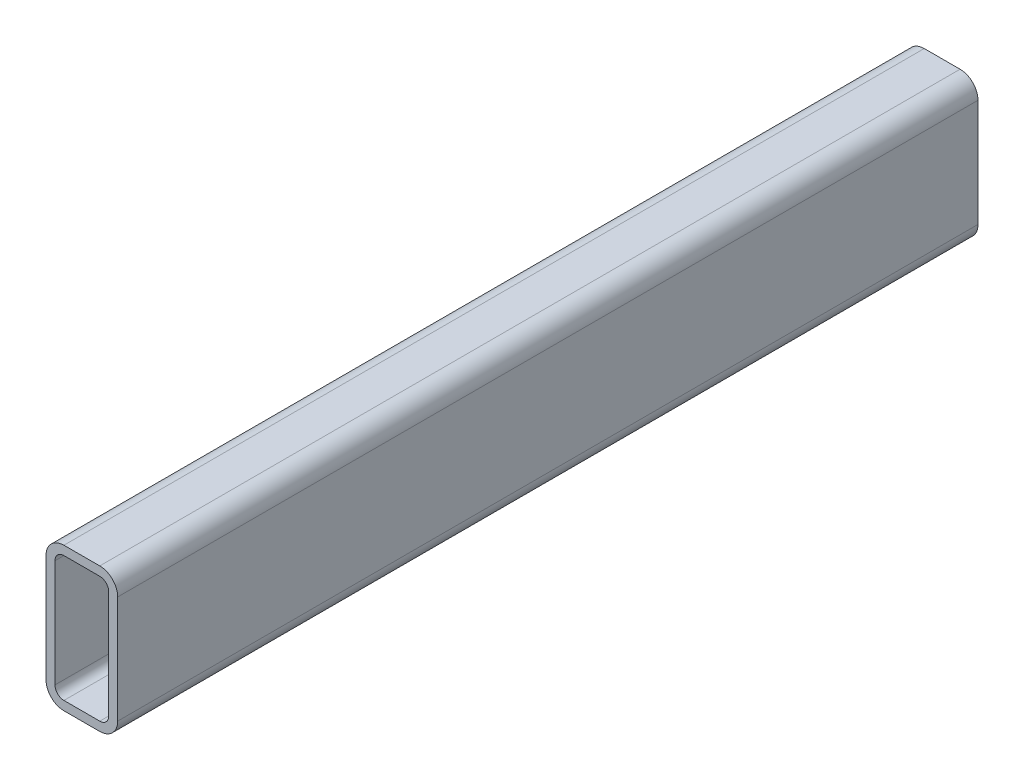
ISO-10303-21;
HEADER;
FILE_DESCRIPTION(('STEP AP214'),'2;1');
FILE_NAME('part.step','',(''),(''),'','','');
FILE_SCHEMA(('AUTOMOTIVE_DESIGN { 1 0 10303 214 1 1 1 1 }'));
ENDSEC;
DATA;
#1=APPLICATION_CONTEXT('core data for automotive mechanical design processes');
#2=APPLICATION_PROTOCOL_DEFINITION('international standard','automotive_design',2000,#1);
#3=PRODUCT_CONTEXT('',#1,'mechanical');
#4=PRODUCT('Part','Part','',(#3));
#5=PRODUCT_RELATED_PRODUCT_CATEGORY('part','',(#4));
#6=PRODUCT_DEFINITION_FORMATION('','',#4);
#7=PRODUCT_DEFINITION_CONTEXT('part definition',#1,'design');
#8=PRODUCT_DEFINITION('design','',#6,#7);
#9=PRODUCT_DEFINITION_SHAPE('','',#8);
#10=(LENGTH_UNIT() NAMED_UNIT(*) SI_UNIT(.MILLI.,.METRE.));
#11=(NAMED_UNIT(*) PLANE_ANGLE_UNIT() SI_UNIT($,.RADIAN.));
#12=(NAMED_UNIT(*) SI_UNIT($,.STERADIAN.) SOLID_ANGLE_UNIT());
#13=UNCERTAINTY_MEASURE_WITH_UNIT(LENGTH_MEASURE(1.E-05),#10,'distance_accuracy_value','');
#14=(GEOMETRIC_REPRESENTATION_CONTEXT(3) GLOBAL_UNCERTAINTY_ASSIGNED_CONTEXT((#13)) GLOBAL_UNIT_ASSIGNED_CONTEXT((#10,
#11,#12)) REPRESENTATION_CONTEXT('',''));
#15=CARTESIAN_POINT('',(0.,0.,0.));
#16=DIRECTION('',(0.,0.,1.));
#17=DIRECTION('',(1.,0.,0.));
#18=AXIS2_PLACEMENT_3D('',#15,#16,#17);
#19=CARTESIAN_POINT('',(6.35,44.45,304.8));
#20=DIRECTION('',(0.,0.,1.));
#21=DIRECTION('',(1.,0.,0.));
#22=AXIS2_PLACEMENT_3D('',#19,#20,#21);
#23=PLANE('',#22);
#24=CARTESIAN_POINT('',(6.35,44.45,304.8));
#25=DIRECTION('',(0.,0.,1.));
#26=DIRECTION('',(1.,0.,0.));
#27=AXIS2_PLACEMENT_3D('',#24,#25,#26);
#28=CIRCLE('',#27,6.35);
#29=CARTESIAN_POINT('',(6.35,50.8,304.8));
#30=VERTEX_POINT('',#29);
#31=CARTESIAN_POINT('',(0.,44.45,304.8));
#32=VERTEX_POINT('',#31);
#33=EDGE_CURVE('E211',#30,#32,#28,.T.);
#34=ORIENTED_EDGE('',*,*,#33,.T.);
#35=DIRECTION('',(0.,-1.,0.));
#36=VECTOR('',#35,1.);
#37=CARTESIAN_POINT('',(0.,6.35,304.8));
#38=LINE('',#37,#36);
#39=CARTESIAN_POINT('',(0.,6.35,304.8));
#40=VERTEX_POINT('',#39);
#41=EDGE_CURVE('E214',#32,#40,#38,.T.);
#42=ORIENTED_EDGE('',*,*,#41,.T.);
#43=CARTESIAN_POINT('',(6.35,6.35,304.8));
#44=DIRECTION('',(0.,0.,1.));
#45=DIRECTION('',(1.,0.,0.));
#46=AXIS2_PLACEMENT_3D('',#43,#44,#45);
#47=CIRCLE('',#46,6.35);
#48=CARTESIAN_POINT('',(6.35,0.,304.8));
#49=VERTEX_POINT('',#48);
#50=EDGE_CURVE('E217',#40,#49,#47,.T.);
#51=ORIENTED_EDGE('',*,*,#50,.T.);
#52=DIRECTION('',(1.,0.,0.));
#53=VECTOR('',#52,1.);
#54=CARTESIAN_POINT('',(19.05,0.,304.8));
#55=LINE('',#54,#53);
#56=CARTESIAN_POINT('',(19.05,0.,304.8));
#57=VERTEX_POINT('',#56);
#58=EDGE_CURVE('E219',#49,#57,#55,.T.);
#59=ORIENTED_EDGE('',*,*,#58,.T.);
#60=CARTESIAN_POINT('',(19.05,6.35,304.8));
#61=DIRECTION('',(0.,0.,1.));
#62=DIRECTION('',(1.,0.,0.));
#63=AXIS2_PLACEMENT_3D('',#60,#61,#62);
#64=CIRCLE('',#63,6.35);
#65=CARTESIAN_POINT('',(25.4,6.35,304.8));
#66=VERTEX_POINT('',#65);
#67=EDGE_CURVE('E221',#57,#66,#64,.T.);
#68=ORIENTED_EDGE('',*,*,#67,.T.);
#69=DIRECTION('',(0.,1.,0.));
#70=VECTOR('',#69,1.);
#71=CARTESIAN_POINT('',(25.4,44.45,304.8));
#72=LINE('',#71,#70);
#73=CARTESIAN_POINT('',(25.4,44.45,304.8));
#74=VERTEX_POINT('',#73);
#75=EDGE_CURVE('E223',#66,#74,#72,.T.);
#76=ORIENTED_EDGE('',*,*,#75,.T.);
#77=CARTESIAN_POINT('',(19.05,44.45,304.8));
#78=DIRECTION('',(0.,0.,1.));
#79=DIRECTION('',(1.,0.,0.));
#80=AXIS2_PLACEMENT_3D('',#77,#78,#79);
#81=CIRCLE('',#80,6.35);
#82=CARTESIAN_POINT('',(19.05,50.8,304.8));
#83=VERTEX_POINT('',#82);
#84=EDGE_CURVE('E225',#74,#83,#81,.T.);
#85=ORIENTED_EDGE('',*,*,#84,.T.);
#86=DIRECTION('',(-1.,0.,0.));
#87=VECTOR('',#86,1.);
#88=CARTESIAN_POINT('',(6.35,50.8,304.8));
#89=LINE('',#88,#87);
#90=EDGE_CURVE('E227',#83,#30,#89,.T.);
#91=ORIENTED_EDGE('',*,*,#90,.T.);
#92=EDGE_LOOP('',(#34,#42,#51,#59,#68,#76,#85,#91));
#93=FACE_BOUND('',#92,.T.);
#94=DIRECTION('',(0.,-1.,0.));
#95=VECTOR('',#94,1.);
#96=CARTESIAN_POINT('',(3.175,6.35,304.8));
#97=LINE('',#96,#95);
#98=CARTESIAN_POINT('',(3.175,44.45,304.8));
#99=VERTEX_POINT('',#98);
#100=CARTESIAN_POINT('',(3.175,6.35,304.8));
#101=VERTEX_POINT('',#100);
#102=EDGE_CURVE('E154',#99,#101,#97,.T.);
#103=ORIENTED_EDGE('',*,*,#102,.F.);
#104=CARTESIAN_POINT('',(6.35,44.45,304.8));
#105=DIRECTION('',(0.,0.,1.));
#106=DIRECTION('',(1.,0.,0.));
#107=AXIS2_PLACEMENT_3D('',#104,#105,#106);
#108=CIRCLE('',#107,3.175);
#109=CARTESIAN_POINT('',(6.35,47.625,304.8));
#110=VERTEX_POINT('',#109);
#111=EDGE_CURVE('E146',#110,#99,#108,.T.);
#112=ORIENTED_EDGE('',*,*,#111,.F.);
#113=DIRECTION('',(-1.,0.,0.));
#114=VECTOR('',#113,1.);
#115=CARTESIAN_POINT('',(6.35,47.625,304.8));
#116=LINE('',#115,#114);
#117=CARTESIAN_POINT('',(19.05,47.625,304.8));
#118=VERTEX_POINT('',#117);
#119=EDGE_CURVE('E179',#118,#110,#116,.T.);
#120=ORIENTED_EDGE('',*,*,#119,.F.);
#121=CARTESIAN_POINT('',(19.05,44.45,304.8));
#122=DIRECTION('',(0.,0.,1.));
#123=DIRECTION('',(1.,0.,0.));
#124=AXIS2_PLACEMENT_3D('',#121,#122,#123);
#125=CIRCLE('',#124,3.175);
#126=CARTESIAN_POINT('',(22.225,44.45,304.8));
#127=VERTEX_POINT('',#126);
#128=EDGE_CURVE('E177',#127,#118,#125,.T.);
#129=ORIENTED_EDGE('',*,*,#128,.F.);
#130=DIRECTION('',(0.,1.,0.));
#131=VECTOR('',#130,1.);
#132=CARTESIAN_POINT('',(22.225,44.45,304.8));
#133=LINE('',#132,#131);
#134=CARTESIAN_POINT('',(22.225,6.35,304.8));
#135=VERTEX_POINT('',#134);
#136=EDGE_CURVE('E175',#135,#127,#133,.T.);
#137=ORIENTED_EDGE('',*,*,#136,.F.);
#138=CARTESIAN_POINT('',(19.05,6.35,304.8));
#139=DIRECTION('',(0.,0.,1.));
#140=DIRECTION('',(1.,0.,0.));
#141=AXIS2_PLACEMENT_3D('',#138,#139,#140);
#142=CIRCLE('',#141,3.175);
#143=CARTESIAN_POINT('',(19.05,3.175,304.8));
#144=VERTEX_POINT('',#143);
#145=EDGE_CURVE('E173',#144,#135,#142,.T.);
#146=ORIENTED_EDGE('',*,*,#145,.F.);
#147=DIRECTION('',(1.,0.,0.));
#148=VECTOR('',#147,1.);
#149=CARTESIAN_POINT('',(19.05,3.175,304.8));
#150=LINE('',#149,#148);
#151=CARTESIAN_POINT('',(6.35,3.175,304.8));
#152=VERTEX_POINT('',#151);
#153=EDGE_CURVE('E169',#152,#144,#150,.T.);
#154=ORIENTED_EDGE('',*,*,#153,.F.);
#155=CARTESIAN_POINT('',(6.35,6.35,304.8));
#156=DIRECTION('',(0.,0.,1.));
#157=DIRECTION('',(1.,0.,0.));
#158=AXIS2_PLACEMENT_3D('',#155,#156,#157);
#159=CIRCLE('',#158,3.175);
#160=EDGE_CURVE('E167',#101,#152,#159,.T.);
#161=ORIENTED_EDGE('',*,*,#160,.F.);
#162=EDGE_LOOP('',(#103,#112,#120,#129,#137,#146,#154,#161));
#163=FACE_BOUND('',#162,.T.);
#164=ADVANCED_FACE('F33',(#93,#163),#23,.T.);
#165=CARTESIAN_POINT('',(6.35,44.45,0.));
#166=DIRECTION('',(0.,0.,1.));
#167=DIRECTION('',(1.,0.,0.));
#168=AXIS2_PLACEMENT_3D('',#165,#166,#167);
#169=PLANE('',#168);
#170=CARTESIAN_POINT('',(6.35,44.45,0.));
#171=DIRECTION('',(0.,0.,1.));
#172=DIRECTION('',(1.,0.,0.));
#173=AXIS2_PLACEMENT_3D('',#170,#171,#172);
#174=CIRCLE('',#173,6.35);
#175=CARTESIAN_POINT('',(6.35,50.8,0.));
#176=VERTEX_POINT('',#175);
#177=CARTESIAN_POINT('',(0.,44.45,0.));
#178=VERTEX_POINT('',#177);
#179=EDGE_CURVE('E162',#176,#178,#174,.T.);
#180=ORIENTED_EDGE('',*,*,#179,.F.);
#181=DIRECTION('',(-1.,0.,0.));
#182=VECTOR('',#181,1.);
#183=CARTESIAN_POINT('',(6.35,50.8,0.));
#184=LINE('',#183,#182);
#185=CARTESIAN_POINT('',(19.05,50.8,0.));
#186=VERTEX_POINT('',#185);
#187=EDGE_CURVE('E215',#186,#176,#184,.T.);
#188=ORIENTED_EDGE('',*,*,#187,.F.);
#189=CARTESIAN_POINT('',(19.05,44.45,0.));
#190=DIRECTION('',(0.,0.,1.));
#191=DIRECTION('',(1.,0.,0.));
#192=AXIS2_PLACEMENT_3D('',#189,#190,#191);
#193=CIRCLE('',#192,6.35);
#194=CARTESIAN_POINT('',(25.4,44.45,0.));
#195=VERTEX_POINT('',#194);
#196=EDGE_CURVE('E242',#195,#186,#193,.T.);
#197=ORIENTED_EDGE('',*,*,#196,.F.);
#198=DIRECTION('',(0.,1.,0.));
#199=VECTOR('',#198,1.);
#200=CARTESIAN_POINT('',(25.4,44.45,0.));
#201=LINE('',#200,#199);
#202=CARTESIAN_POINT('',(25.4,6.35,0.));
#203=VERTEX_POINT('',#202);
#204=EDGE_CURVE('E240',#203,#195,#201,.T.);
#205=ORIENTED_EDGE('',*,*,#204,.F.);
#206=CARTESIAN_POINT('',(19.05,6.35,0.));
#207=DIRECTION('',(0.,0.,1.));
#208=DIRECTION('',(1.,0.,0.));
#209=AXIS2_PLACEMENT_3D('',#206,#207,#208);
#210=CIRCLE('',#209,6.35);
#211=CARTESIAN_POINT('',(19.05,0.,0.));
#212=VERTEX_POINT('',#211);
#213=EDGE_CURVE('E238',#212,#203,#210,.T.);
#214=ORIENTED_EDGE('',*,*,#213,.F.);
#215=DIRECTION('',(1.,0.,0.));
#216=VECTOR('',#215,1.);
#217=CARTESIAN_POINT('',(19.05,0.,0.));
#218=LINE('',#217,#216);
#219=CARTESIAN_POINT('',(6.35,0.,0.));
#220=VERTEX_POINT('',#219);
#221=EDGE_CURVE('E236',#220,#212,#218,.T.);
#222=ORIENTED_EDGE('',*,*,#221,.F.);
#223=CARTESIAN_POINT('',(6.35,6.35,0.));
#224=DIRECTION('',(0.,0.,1.));
#225=DIRECTION('',(1.,0.,0.));
#226=AXIS2_PLACEMENT_3D('',#223,#224,#225);
#227=CIRCLE('',#226,6.35);
#228=CARTESIAN_POINT('',(0.,6.35,0.));
#229=VERTEX_POINT('',#228);
#230=EDGE_CURVE('E234',#229,#220,#227,.T.);
#231=ORIENTED_EDGE('',*,*,#230,.F.);
#232=DIRECTION('',(0.,-1.,0.));
#233=VECTOR('',#232,1.);
#234=CARTESIAN_POINT('',(0.,6.35,0.));
#235=LINE('',#234,#233);
#236=EDGE_CURVE('E232',#178,#229,#235,.T.);
#237=ORIENTED_EDGE('',*,*,#236,.F.);
#238=EDGE_LOOP('',(#180,#188,#197,#205,#214,#222,#231,#237));
#239=FACE_BOUND('',#238,.T.);
#240=CARTESIAN_POINT('',(6.35,44.45,0.));
#241=DIRECTION('',(0.,0.,1.));
#242=DIRECTION('',(1.,0.,0.));
#243=AXIS2_PLACEMENT_3D('',#240,#241,#242);
#244=CIRCLE('',#243,3.175);
#245=CARTESIAN_POINT('',(6.35,47.625,0.));
#246=VERTEX_POINT('',#245);
#247=CARTESIAN_POINT('',(3.175,44.45,0.));
#248=VERTEX_POINT('',#247);
#249=EDGE_CURVE('E56',#246,#248,#244,.T.);
#250=ORIENTED_EDGE('',*,*,#249,.T.);
#251=DIRECTION('',(0.,-1.,0.));
#252=VECTOR('',#251,1.);
#253=CARTESIAN_POINT('',(3.175,6.35,0.));
#254=LINE('',#253,#252);
#255=CARTESIAN_POINT('',(3.175,6.35,0.));
#256=VERTEX_POINT('',#255);
#257=EDGE_CURVE('E161',#248,#256,#254,.T.);
#258=ORIENTED_EDGE('',*,*,#257,.T.);
#259=CARTESIAN_POINT('',(6.35,6.35,0.));
#260=DIRECTION('',(0.,0.,1.));
#261=DIRECTION('',(1.,0.,0.));
#262=AXIS2_PLACEMENT_3D('',#259,#260,#261);
#263=CIRCLE('',#262,3.175);
#264=CARTESIAN_POINT('',(6.35,3.175,0.));
#265=VERTEX_POINT('',#264);
#266=EDGE_CURVE('E183',#256,#265,#263,.T.);
#267=ORIENTED_EDGE('',*,*,#266,.T.);
#268=DIRECTION('',(1.,0.,0.));
#269=VECTOR('',#268,1.);
#270=CARTESIAN_POINT('',(19.05,3.175,0.));
#271=LINE('',#270,#269);
#272=CARTESIAN_POINT('',(19.05,3.175,0.));
#273=VERTEX_POINT('',#272);
#274=EDGE_CURVE('E186',#265,#273,#271,.T.);
#275=ORIENTED_EDGE('',*,*,#274,.T.);
#276=CARTESIAN_POINT('',(19.05,6.35,0.));
#277=DIRECTION('',(0.,0.,1.));
#278=DIRECTION('',(1.,0.,0.));
#279=AXIS2_PLACEMENT_3D('',#276,#277,#278);
#280=CIRCLE('',#279,3.175);
#281=CARTESIAN_POINT('',(22.225,6.35,0.));
#282=VERTEX_POINT('',#281);
#283=EDGE_CURVE('E189',#273,#282,#280,.T.);
#284=ORIENTED_EDGE('',*,*,#283,.T.);
#285=DIRECTION('',(0.,1.,0.));
#286=VECTOR('',#285,1.);
#287=CARTESIAN_POINT('',(22.225,44.45,0.));
#288=LINE('',#287,#286);
#289=CARTESIAN_POINT('',(22.225,44.45,0.));
#290=VERTEX_POINT('',#289);
#291=EDGE_CURVE('E192',#282,#290,#288,.T.);
#292=ORIENTED_EDGE('',*,*,#291,.T.);
#293=CARTESIAN_POINT('',(19.05,44.45,0.));
#294=DIRECTION('',(0.,0.,1.));
#295=DIRECTION('',(1.,0.,0.));
#296=AXIS2_PLACEMENT_3D('',#293,#294,#295);
#297=CIRCLE('',#296,3.175);
#298=CARTESIAN_POINT('',(19.05,47.625,0.));
#299=VERTEX_POINT('',#298);
#300=EDGE_CURVE('E195',#290,#299,#297,.T.);
#301=ORIENTED_EDGE('',*,*,#300,.T.);
#302=DIRECTION('',(-1.,0.,0.));
#303=VECTOR('',#302,1.);
#304=CARTESIAN_POINT('',(6.35,47.625,0.));
#305=LINE('',#304,#303);
#306=EDGE_CURVE('E155',#299,#246,#305,.T.);
#307=ORIENTED_EDGE('',*,*,#306,.T.);
#308=EDGE_LOOP('',(#250,#258,#267,#275,#284,#292,#301,#307));
#309=FACE_BOUND('',#308,.T.);
#310=ADVANCED_FACE('F272',(#239,#309),#169,.F.);
#311=CARTESIAN_POINT('',(6.35,44.45,304.8));
#312=DIRECTION('',(0.,0.,-1.));
#313=DIRECTION('',(-1.,0.,0.));
#314=AXIS2_PLACEMENT_3D('',#311,#312,#313);
#315=CYLINDRICAL_SURFACE('',#314,6.35);
#316=ORIENTED_EDGE('',*,*,#179,.T.);
#317=DIRECTION('',(0.,0.,-1.));
#318=VECTOR('',#317,1.);
#319=CARTESIAN_POINT('',(0.,44.45,304.8));
#320=LINE('',#319,#318);
#321=EDGE_CURVE('E11',#32,#178,#320,.T.);
#322=ORIENTED_EDGE('',*,*,#321,.F.);
#323=ORIENTED_EDGE('',*,*,#33,.F.);
#324=DIRECTION('',(0.,0.,-1.));
#325=VECTOR('',#324,1.);
#326=CARTESIAN_POINT('',(6.35,50.8,304.8));
#327=LINE('',#326,#325);
#328=EDGE_CURVE('E229',#30,#176,#327,.T.);
#329=ORIENTED_EDGE('',*,*,#328,.T.);
#330=EDGE_LOOP('',(#316,#322,#323,#329));
#331=FACE_BOUND('',#330,.T.);
#332=ADVANCED_FACE('F35',(#331),#315,.T.);
#333=CARTESIAN_POINT('',(0.,6.35,304.8));
#334=DIRECTION('',(1.,0.,0.));
#335=DIRECTION('',(0.,0.,-1.));
#336=AXIS2_PLACEMENT_3D('',#333,#334,#335);
#337=PLANE('',#336);
#338=ORIENTED_EDGE('',*,*,#236,.T.);
#339=DIRECTION('',(0.,0.,-1.));
#340=VECTOR('',#339,1.);
#341=CARTESIAN_POINT('',(0.,6.35,304.8));
#342=LINE('',#341,#340);
#343=EDGE_CURVE('E41',#40,#229,#342,.T.);
#344=ORIENTED_EDGE('',*,*,#343,.F.);
#345=ORIENTED_EDGE('',*,*,#41,.F.);
#346=ORIENTED_EDGE('',*,*,#321,.T.);
#347=EDGE_LOOP('',(#338,#344,#345,#346));
#348=FACE_BOUND('',#347,.T.);
#349=ADVANCED_FACE('F289',(#348),#337,.F.);
#350=CARTESIAN_POINT('',(6.35,6.35,304.8));
#351=DIRECTION('',(0.,0.,-1.));
#352=DIRECTION('',(-1.,0.,0.));
#353=AXIS2_PLACEMENT_3D('',#350,#351,#352);
#354=CYLINDRICAL_SURFACE('',#353,6.35);
#355=ORIENTED_EDGE('',*,*,#230,.T.);
#356=DIRECTION('',(0.,0.,-1.));
#357=VECTOR('',#356,1.);
#358=CARTESIAN_POINT('',(6.35,0.,304.8));
#359=LINE('',#358,#357);
#360=EDGE_CURVE('E259',#49,#220,#359,.T.);
#361=ORIENTED_EDGE('',*,*,#360,.F.);
#362=ORIENTED_EDGE('',*,*,#50,.F.);
#363=ORIENTED_EDGE('',*,*,#343,.T.);
#364=EDGE_LOOP('',(#355,#361,#362,#363));
#365=FACE_BOUND('',#364,.T.);
#366=ADVANCED_FACE('F266',(#365),#354,.T.);
#367=CARTESIAN_POINT('',(19.05,0.,304.8));
#368=DIRECTION('',(0.,1.,0.));
#369=DIRECTION('',(0.,0.,1.));
#370=AXIS2_PLACEMENT_3D('',#367,#368,#369);
#371=PLANE('',#370);
#372=ORIENTED_EDGE('',*,*,#221,.T.);
#373=DIRECTION('',(0.,0.,-1.));
#374=VECTOR('',#373,1.);
#375=CARTESIAN_POINT('',(19.05,0.,304.8));
#376=LINE('',#375,#374);
#377=EDGE_CURVE('E256',#57,#212,#376,.T.);
#378=ORIENTED_EDGE('',*,*,#377,.F.);
#379=ORIENTED_EDGE('',*,*,#58,.F.);
#380=ORIENTED_EDGE('',*,*,#360,.T.);
#381=EDGE_LOOP('',(#372,#378,#379,#380));
#382=FACE_BOUND('',#381,.T.);
#383=ADVANCED_FACE('F278',(#382),#371,.F.);
#384=CARTESIAN_POINT('',(19.05,6.35,304.8));
#385=DIRECTION('',(0.,0.,-1.));
#386=DIRECTION('',(-1.,0.,0.));
#387=AXIS2_PLACEMENT_3D('',#384,#385,#386);
#388=CYLINDRICAL_SURFACE('',#387,6.35);
#389=ORIENTED_EDGE('',*,*,#213,.T.);
#390=DIRECTION('',(0.,0.,-1.));
#391=VECTOR('',#390,1.);
#392=CARTESIAN_POINT('',(25.4,6.35,304.8));
#393=LINE('',#392,#391);
#394=EDGE_CURVE('E253',#66,#203,#393,.T.);
#395=ORIENTED_EDGE('',*,*,#394,.F.);
#396=ORIENTED_EDGE('',*,*,#67,.F.);
#397=ORIENTED_EDGE('',*,*,#377,.T.);
#398=EDGE_LOOP('',(#389,#395,#396,#397));
#399=FACE_BOUND('',#398,.T.);
#400=ADVANCED_FACE('F282',(#399),#388,.T.);
#401=CARTESIAN_POINT('',(25.4,44.45,304.8));
#402=DIRECTION('',(-1.,0.,0.));
#403=DIRECTION('',(0.,0.,1.));
#404=AXIS2_PLACEMENT_3D('',#401,#402,#403);
#405=PLANE('',#404);
#406=ORIENTED_EDGE('',*,*,#204,.T.);
#407=DIRECTION('',(0.,0.,-1.));
#408=VECTOR('',#407,1.);
#409=CARTESIAN_POINT('',(25.4,44.45,304.8));
#410=LINE('',#409,#408);
#411=EDGE_CURVE('E250',#74,#195,#410,.T.);
#412=ORIENTED_EDGE('',*,*,#411,.F.);
#413=ORIENTED_EDGE('',*,*,#75,.F.);
#414=ORIENTED_EDGE('',*,*,#394,.T.);
#415=EDGE_LOOP('',(#406,#412,#413,#414));
#416=FACE_BOUND('',#415,.T.);
#417=ADVANCED_FACE('F302',(#416),#405,.F.);
#418=CARTESIAN_POINT('',(19.05,44.45,304.8));
#419=DIRECTION('',(0.,0.,-1.));
#420=DIRECTION('',(-1.,0.,0.));
#421=AXIS2_PLACEMENT_3D('',#418,#419,#420);
#422=CYLINDRICAL_SURFACE('',#421,6.35);
#423=ORIENTED_EDGE('',*,*,#196,.T.);
#424=DIRECTION('',(0.,0.,-1.));
#425=VECTOR('',#424,1.);
#426=CARTESIAN_POINT('',(19.05,50.8,304.8));
#427=LINE('',#426,#425);
#428=EDGE_CURVE('E247',#83,#186,#427,.T.);
#429=ORIENTED_EDGE('',*,*,#428,.F.);
#430=ORIENTED_EDGE('',*,*,#84,.F.);
#431=ORIENTED_EDGE('',*,*,#411,.T.);
#432=EDGE_LOOP('',(#423,#429,#430,#431));
#433=FACE_BOUND('',#432,.T.);
#434=ADVANCED_FACE('F300',(#433),#422,.T.);
#435=CARTESIAN_POINT('',(6.35,50.8,304.8));
#436=DIRECTION('',(0.,-1.,0.));
#437=DIRECTION('',(0.,0.,-1.));
#438=AXIS2_PLACEMENT_3D('',#435,#436,#437);
#439=PLANE('',#438);
#440=ORIENTED_EDGE('',*,*,#187,.T.);
#441=ORIENTED_EDGE('',*,*,#328,.F.);
#442=ORIENTED_EDGE('',*,*,#90,.F.);
#443=ORIENTED_EDGE('',*,*,#428,.T.);
#444=EDGE_LOOP('',(#440,#441,#442,#443));
#445=FACE_BOUND('',#444,.T.);
#446=ADVANCED_FACE('F295',(#445),#439,.F.);
#447=CARTESIAN_POINT('',(6.35,44.45,304.8));
#448=DIRECTION('',(0.,0.,-1.));
#449=DIRECTION('',(-1.,0.,0.));
#450=AXIS2_PLACEMENT_3D('',#447,#448,#449);
#451=CYLINDRICAL_SURFACE('',#450,3.175);
#452=ORIENTED_EDGE('',*,*,#249,.F.);
#453=DIRECTION('',(0.,0.,-1.));
#454=VECTOR('',#453,1.);
#455=CARTESIAN_POINT('',(6.35,47.625,304.8));
#456=LINE('',#455,#454);
#457=EDGE_CURVE('E150',#110,#246,#456,.T.);
#458=ORIENTED_EDGE('',*,*,#457,.F.);
#459=ORIENTED_EDGE('',*,*,#111,.T.);
#460=DIRECTION('',(0.,0.,-1.));
#461=VECTOR('',#460,1.);
#462=CARTESIAN_POINT('',(3.175,44.45,304.8));
#463=LINE('',#462,#461);
#464=EDGE_CURVE('E149',#99,#248,#463,.T.);
#465=ORIENTED_EDGE('',*,*,#464,.T.);
#466=EDGE_LOOP('',(#452,#458,#459,#465));
#467=FACE_BOUND('',#466,.T.);
#468=ADVANCED_FACE('F148',(#467),#451,.F.);
#469=CARTESIAN_POINT('',(3.175,6.35,304.8));
#470=DIRECTION('',(1.,0.,0.));
#471=DIRECTION('',(0.,0.,-1.));
#472=AXIS2_PLACEMENT_3D('',#469,#470,#471);
#473=PLANE('',#472);
#474=ORIENTED_EDGE('',*,*,#257,.F.);
#475=ORIENTED_EDGE('',*,*,#464,.F.);
#476=ORIENTED_EDGE('',*,*,#102,.T.);
#477=DIRECTION('',(0.,0.,-1.));
#478=VECTOR('',#477,1.);
#479=CARTESIAN_POINT('',(3.175,6.35,304.8));
#480=LINE('',#479,#478);
#481=EDGE_CURVE('E163',#101,#256,#480,.T.);
#482=ORIENTED_EDGE('',*,*,#481,.T.);
#483=EDGE_LOOP('',(#474,#475,#476,#482));
#484=FACE_BOUND('',#483,.T.);
#485=ADVANCED_FACE('F158',(#484),#473,.T.);
#486=CARTESIAN_POINT('',(6.35,6.35,304.8));
#487=DIRECTION('',(0.,0.,-1.));
#488=DIRECTION('',(-1.,0.,0.));
#489=AXIS2_PLACEMENT_3D('',#486,#487,#488);
#490=CYLINDRICAL_SURFACE('',#489,3.175);
#491=ORIENTED_EDGE('',*,*,#266,.F.);
#492=ORIENTED_EDGE('',*,*,#481,.F.);
#493=ORIENTED_EDGE('',*,*,#160,.T.);
#494=DIRECTION('',(0.,0.,-1.));
#495=VECTOR('',#494,1.);
#496=CARTESIAN_POINT('',(6.35,3.175,304.8));
#497=LINE('',#496,#495);
#498=EDGE_CURVE('E208',#152,#265,#497,.T.);
#499=ORIENTED_EDGE('',*,*,#498,.T.);
#500=EDGE_LOOP('',(#491,#492,#493,#499));
#501=FACE_BOUND('',#500,.T.);
#502=ADVANCED_FACE('F327',(#501),#490,.F.);
#503=CARTESIAN_POINT('',(19.05,3.175,304.8));
#504=DIRECTION('',(0.,1.,0.));
#505=DIRECTION('',(0.,0.,1.));
#506=AXIS2_PLACEMENT_3D('',#503,#504,#505);
#507=PLANE('',#506);
#508=ORIENTED_EDGE('',*,*,#274,.F.);
#509=ORIENTED_EDGE('',*,*,#498,.F.);
#510=ORIENTED_EDGE('',*,*,#153,.T.);
#511=DIRECTION('',(0.,0.,-1.));
#512=VECTOR('',#511,1.);
#513=CARTESIAN_POINT('',(19.05,3.175,304.8));
#514=LINE('',#513,#512);
#515=EDGE_CURVE('E206',#144,#273,#514,.T.);
#516=ORIENTED_EDGE('',*,*,#515,.T.);
#517=EDGE_LOOP('',(#508,#509,#510,#516));
#518=FACE_BOUND('',#517,.T.);
#519=ADVANCED_FACE('F331',(#518),#507,.T.);
#520=CARTESIAN_POINT('',(19.05,6.35,304.8));
#521=DIRECTION('',(0.,0.,-1.));
#522=DIRECTION('',(-1.,0.,0.));
#523=AXIS2_PLACEMENT_3D('',#520,#521,#522);
#524=CYLINDRICAL_SURFACE('',#523,3.175);
#525=ORIENTED_EDGE('',*,*,#283,.F.);
#526=ORIENTED_EDGE('',*,*,#515,.F.);
#527=ORIENTED_EDGE('',*,*,#145,.T.);
#528=DIRECTION('',(0.,0.,-1.));
#529=VECTOR('',#528,1.);
#530=CARTESIAN_POINT('',(22.225,6.35,304.8));
#531=LINE('',#530,#529);
#532=EDGE_CURVE('E204',#135,#282,#531,.T.);
#533=ORIENTED_EDGE('',*,*,#532,.T.);
#534=EDGE_LOOP('',(#525,#526,#527,#533));
#535=FACE_BOUND('',#534,.T.);
#536=ADVANCED_FACE('F337',(#535),#524,.F.);
#537=CARTESIAN_POINT('',(22.225,44.45,304.8));
#538=DIRECTION('',(-1.,0.,0.));
#539=DIRECTION('',(0.,0.,1.));
#540=AXIS2_PLACEMENT_3D('',#537,#538,#539);
#541=PLANE('',#540);
#542=ORIENTED_EDGE('',*,*,#291,.F.);
#543=ORIENTED_EDGE('',*,*,#532,.F.);
#544=ORIENTED_EDGE('',*,*,#136,.T.);
#545=DIRECTION('',(0.,0.,-1.));
#546=VECTOR('',#545,1.);
#547=CARTESIAN_POINT('',(22.225,44.45,304.8));
#548=LINE('',#547,#546);
#549=EDGE_CURVE('E202',#127,#290,#548,.T.);
#550=ORIENTED_EDGE('',*,*,#549,.T.);
#551=EDGE_LOOP('',(#542,#543,#544,#550));
#552=FACE_BOUND('',#551,.T.);
#553=ADVANCED_FACE('F341',(#552),#541,.T.);
#554=CARTESIAN_POINT('',(19.05,44.45,304.8));
#555=DIRECTION('',(0.,0.,-1.));
#556=DIRECTION('',(-1.,0.,0.));
#557=AXIS2_PLACEMENT_3D('',#554,#555,#556);
#558=CYLINDRICAL_SURFACE('',#557,3.175);
#559=ORIENTED_EDGE('',*,*,#300,.F.);
#560=ORIENTED_EDGE('',*,*,#549,.F.);
#561=ORIENTED_EDGE('',*,*,#128,.T.);
#562=DIRECTION('',(0.,0.,-1.));
#563=VECTOR('',#562,1.);
#564=CARTESIAN_POINT('',(19.05,47.625,304.8));
#565=LINE('',#564,#563);
#566=EDGE_CURVE('E48',#118,#299,#565,.T.);
#567=ORIENTED_EDGE('',*,*,#566,.T.);
#568=EDGE_LOOP('',(#559,#560,#561,#567));
#569=FACE_BOUND('',#568,.T.);
#570=ADVANCED_FACE('F345',(#569),#558,.F.);
#571=CARTESIAN_POINT('',(6.35,47.625,304.8));
#572=DIRECTION('',(0.,-1.,0.));
#573=DIRECTION('',(0.,0.,-1.));
#574=AXIS2_PLACEMENT_3D('',#571,#572,#573);
#575=PLANE('',#574);
#576=ORIENTED_EDGE('',*,*,#306,.F.);
#577=ORIENTED_EDGE('',*,*,#566,.F.);
#578=ORIENTED_EDGE('',*,*,#119,.T.);
#579=ORIENTED_EDGE('',*,*,#457,.T.);
#580=EDGE_LOOP('',(#576,#577,#578,#579));
#581=FACE_BOUND('',#580,.T.);
#582=ADVANCED_FACE('F349',(#581),#575,.T.);
#583=CLOSED_SHELL('',(#164,#310,#332,#349,#366,#383,#400,#417,#434,#446,#468,#485,#502,#519,
#536,#553,#570,#582));
#584=MANIFOLD_SOLID_BREP('B2',#583);
#585=ADVANCED_BREP_SHAPE_REPRESENTATION('',(#18,#584),#14);
#586=SHAPE_DEFINITION_REPRESENTATION(#9,#585);
ENDSEC;
END-ISO-10303-21;
